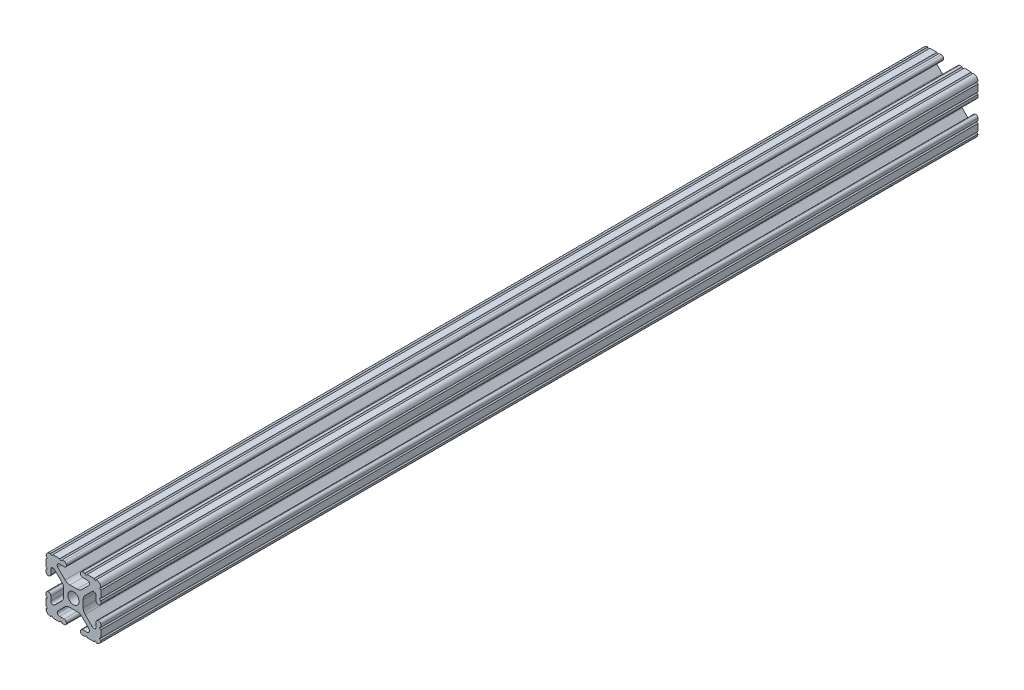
from build123d import *

# Parameters (mm, degrees)
SKETCH1_R           = 2.6035
BOSS_EXTRUDE1_DEPTH = 203.2


with BuildPart() as part:
    # Sketch1 → Boss-Extrude1 (new, symmetric)
    with BuildSketch(Plane.XY):
        with BuildLine():
            Line((-7.179650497, -8.645192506), (-3.952270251, -5.423690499))
            ThreePointArc((-3.952270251, -5.423690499), (-2.922936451, -4.736929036), (-1.709253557, -4.4958))
            Line((-1.709253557, -4.4958), (1.709253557, -4.4958))
            ThreePointArc((1.709253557, -4.4958), (2.922936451, -4.736929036), (3.952270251, -5.423690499))
            Line((3.952270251, -5.423690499), (7.179650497, -8.645192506))
            ThreePointArc((7.179650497, -8.645192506), (7.41473083, -9.822813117), (6.416408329, -10.4902))
            Line((6.416408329, -10.4902), (4.287512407, -10.4902))
            ThreePointArc((4.287512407, -10.4902), (3.54574862, -10.79744862), (3.2385, -11.539212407))
            Line((3.2385, -11.539212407), (3.2385, -11.650987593))
            ThreePointArc((3.2385, -11.650987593), (3.54574862, -12.39275138), (4.287512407, -12.7))
            Line((4.287512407, -12.7), (5.317126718, -12.7))
            ThreePointArc((5.317126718, -12.7), (5.825126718, -12.192), (6.333126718, -12.7))
            Line((6.333126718, -12.7), (9.550443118, -12.7))
            ThreePointArc((9.550443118, -12.7), (10.058366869, -12.192000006), (10.566443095, -12.699847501))
            ThreePointArc((10.566443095, -12.699847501), (12.082537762, -12.08250727), (12.699846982, -10.566399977))
            ThreePointArc((12.699846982, -10.566399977), (12.192000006, -10.058323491), (12.7, -9.5504))
            Line((12.7, -9.5504), (12.7, -6.3330836))
            ThreePointArc((12.7, -6.3330836), (12.192, -5.8250836), (12.7, -5.3170836))
            Line((12.7, -5.3170836), (12.7, -4.287469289))
            ThreePointArc((12.7, -4.287469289), (12.39275138, -3.545705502), (11.650987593, -3.238456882))
            Line((11.650987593, -3.238456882), (11.539212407, -3.238456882))
            ThreePointArc((11.539212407, -3.238456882), (10.79744862, -3.545705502), (10.4902, -4.287469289))
            Line((10.4902, -4.287469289), (10.4902, -6.402089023))
            ThreePointArc((10.4902, -6.402089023), (9.856505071, -7.351067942), (8.737131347, -7.129408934))
            Line((8.737131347, -7.129408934), (5.441005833, -3.840816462))
            ThreePointArc((5.441005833, -3.840816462), (4.750877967, -2.809883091), (4.5085, -1.593185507))
            Line((4.5085, -1.593185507), (4.5085, 1.593185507))
            ThreePointArc((4.5085, 1.593185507), (4.750877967, 2.809883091), (5.441005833, 3.840816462))
            Line((5.441005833, 3.840816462), (8.737131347, 7.129408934))
            ThreePointArc((8.737131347, 7.129408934), (9.856505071, 7.351067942), (10.4902, 6.402089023))
            Line((10.4902, 6.402089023), (10.4902, 4.287469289))
            ThreePointArc((10.4902, 4.287469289), (10.79744862, 3.545705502), (11.539212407, 3.238456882))
            Line((11.539212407, 3.238456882), (11.650987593, 3.238456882))
            ThreePointArc((11.650987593, 3.238456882), (12.39275138, 3.545705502), (12.7, 4.287469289))
            Line((12.7, 4.287469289), (12.7, 5.3170836))
            ThreePointArc((12.7, 5.3170836), (12.192, 5.8250836), (12.7, 6.3330836))
            Line((12.7, 6.3330836), (12.7, 9.5504))
            ThreePointArc((12.7, 9.5504), (12.192000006, 10.058323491), (12.699846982, 10.566399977))
            ThreePointArc((12.699846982, 10.566399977), (12.082537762, 12.08250727), (10.566443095, 12.699847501))
            ThreePointArc((10.566443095, 12.699847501), (10.058366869, 12.192000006), (9.550443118, 12.7))
            Line((9.550443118, 12.7), (6.333126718, 12.7))
            ThreePointArc((6.333126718, 12.7), (5.825126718, 12.192), (5.317126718, 12.7))
            Line((5.317126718, 12.7), (4.287512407, 12.7))
            ThreePointArc((4.287512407, 12.7), (3.54574862, 12.39275138), (3.2385, 11.650987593))
            Line((3.2385, 11.650987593), (3.2385, 11.539212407))
            ThreePointArc((3.2385, 11.539212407), (3.54574862, 10.79744862), (4.287512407, 10.4902))
            Line((4.287512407, 10.4902), (6.476788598, 10.4902))
            ThreePointArc((6.476788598, 10.4902), (7.432222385, 9.85140422), (7.207036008, 8.724370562))
            Line((7.207036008, 8.724370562), (3.898272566, 5.423169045))
            ThreePointArc((3.898272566, 5.423169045), (2.869120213, 4.736787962), (1.655778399, 4.4958))
            Line((1.655778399, 4.4958), (-1.655778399, 4.4958))
            ThreePointArc((-1.655778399, 4.4958), (-2.869120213, 4.736787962), (-3.898272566, 5.423169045))
            Line((-3.898272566, 5.423169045), (-7.207036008, 8.724370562))
            ThreePointArc((-7.207036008, 8.724370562), (-7.432222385, 9.85140422), (-6.476788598, 10.4902))
            Line((-6.476788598, 10.4902), (-4.287512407, 10.4902))
            ThreePointArc((-4.287512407, 10.4902), (-3.54574862, 10.79744862), (-3.2385, 11.539212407))
            Line((-3.2385, 11.539212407), (-3.2385, 11.650987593))
            ThreePointArc((-3.2385, 11.650987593), (-3.54574862, 12.39275138), (-4.287512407, 12.7))
            Line((-4.287512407, 12.7), (-5.317126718, 12.7))
            ThreePointArc((-5.317126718, 12.7), (-5.825126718, 12.192), (-6.333126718, 12.7))
            Line((-6.333126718, 12.7), (-9.550443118, 12.7))
            ThreePointArc((-9.550443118, 12.7), (-10.058366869, 12.192000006), (-10.566443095, 12.699847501))
            ThreePointArc((-10.566443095, 12.699847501), (-12.082537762, 12.08250727), (-12.699846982, 10.566399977))
            ThreePointArc((-12.699846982, 10.566399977), (-12.192000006, 10.058323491), (-12.7, 9.5504))
            Line((-12.7, 9.5504), (-12.7, 6.3330836))
            ThreePointArc((-12.7, 6.3330836), (-12.192, 5.8250836), (-12.7, 5.3170836))
            Line((-12.7, 5.3170836), (-12.7, 4.287469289))
            ThreePointArc((-12.7, 4.287469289), (-12.39275138, 3.545705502), (-11.650987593, 3.238456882))
            Line((-11.650987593, 3.238456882), (-11.539212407, 3.238456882))
            ThreePointArc((-11.539212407, 3.238456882), (-10.79744862, 3.545705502), (-10.4902, 4.287469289))
            Line((-10.4902, 4.287469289), (-10.4902, 6.402089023))
            ThreePointArc((-10.4902, 6.402089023), (-9.856505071, 7.351067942), (-8.737131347, 7.129408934))
            Line((-8.737131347, 7.129408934), (-5.441005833, 3.840816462))
            ThreePointArc((-5.441005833, 3.840816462), (-4.750877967, 2.809883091), (-4.5085, 1.593185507))
            Line((-4.5085, 1.593185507), (-4.5085, -1.593185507))
            ThreePointArc((-4.5085, -1.593185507), (-4.750877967, -2.809883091), (-5.441005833, -3.840816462))
            Line((-5.441005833, -3.840816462), (-8.737131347, -7.129408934))
            ThreePointArc((-8.737131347, -7.129408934), (-9.856505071, -7.351067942), (-10.4902, -6.402089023))
            Line((-10.4902, -6.402089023), (-10.4902, -4.287469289))
            ThreePointArc((-10.4902, -4.287469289), (-10.79744862, -3.545705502), (-11.539212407, -3.238456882))
            Line((-11.539212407, -3.238456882), (-11.650987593, -3.238456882))
            ThreePointArc((-11.650987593, -3.238456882), (-12.39275138, -3.545705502), (-12.7, -4.287469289))
            Line((-12.7, -4.287469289), (-12.7, -5.3170836))
            ThreePointArc((-12.7, -5.3170836), (-12.192, -5.8250836), (-12.7, -6.3330836))
            Line((-12.7, -6.3330836), (-12.7, -9.5504))
            ThreePointArc((-12.7, -9.5504), (-12.192000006, -10.058323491), (-12.699846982, -10.566399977))
            ThreePointArc((-12.699846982, -10.566399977), (-12.082537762, -12.08250727), (-10.566443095, -12.699847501))
            ThreePointArc((-10.566443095, -12.699847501), (-10.058366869, -12.192000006), (-9.550443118, -12.7))
            Line((-9.550443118, -12.7), (-6.333126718, -12.7))
            ThreePointArc((-6.333126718, -12.7), (-5.825126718, -12.192), (-5.317126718, -12.7))
            Line((-5.317126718, -12.7), (-4.287512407, -12.7))
            ThreePointArc((-4.287512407, -12.7), (-3.54574862, -12.39275138), (-3.2385, -11.650987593))
            Line((-3.2385, -11.650987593), (-3.2385, -11.539212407))
            ThreePointArc((-3.2385, -11.539212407), (-3.54574862, -10.79744862), (-4.287512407, -10.4902))
            Line((-4.287512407, -10.4902), (-6.416408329, -10.4902))
            ThreePointArc((-6.416408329, -10.4902), (-7.41473083, -9.822813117), (-7.179650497, -8.645192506))
        make_face()
        Circle(SKETCH1_R, mode=Mode.SUBTRACT)
    extrude(amount=BOSS_EXTRUDE1_DEPTH, both=True)


solid = part.part
